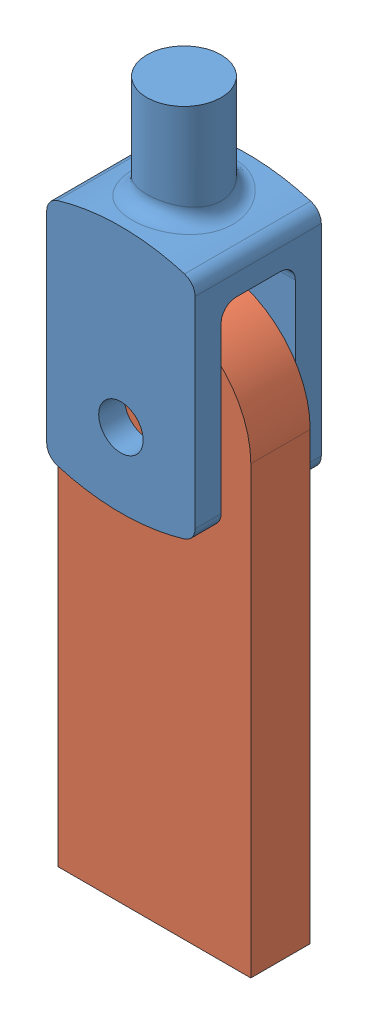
SolidWorks assembly Clevis Assy.SLDASM, configuration No Pin (file format 3400). Lengths in mm.
Overall size (33.02 122.83 21.59).
3 component instances, 3 part files, 5 mates.
Components (placement in the parent):
- bracket-1: bracket.SLDPRT [Default] at origin size (25.4 59.33 21.59)
- link-1: link.SLDPRT [Default] at (0 -46.629 0) size (33.02 92.71 10.16)
- Pin-1: Pin.SLDPRT [Default] at (0 -46.629 -15.0365) x (0.640217 0.768194 0) z (-0.768194 0.640217 0) size (12.7 32.18 12.7) (suppressed, hidden)
Mates (geometry in assembly coordinates):
- Concentric1: concentric anti-aligned: cylinder of bracket-1; cylinder of link-1
- Width1: width: plane of link-1 through (0 -46.629 5.08) normal (0 0 1); plane of link-1 through (0 -46.629 -5.08) normal (0 0 -1); plane of bracket-1 through (-12.7 -24.491 6.35) normal (0 0 -1); plane of bracket-1 through (-12.7 -24.491 -6.35) normal (0 0 1)
- Parallel1: parallel aligned: plane of bracket-1 through (12.7 -57.15 10.795) normal (1 0 0); plane of link-1 through (16.51 -46.629 5.08) normal (1 0 0)
- Concentric31: concentric aligned: cylinder of bracket-1; cylinder of Pin-1
- Coincident31: coincident anti-aligned: plane of bracket-1 through (0 -54.971 -10.795) normal (0 0 -1); plane of Pin-1 through (2.4392 -43.7022 -10.795) normal (0 0 1)
